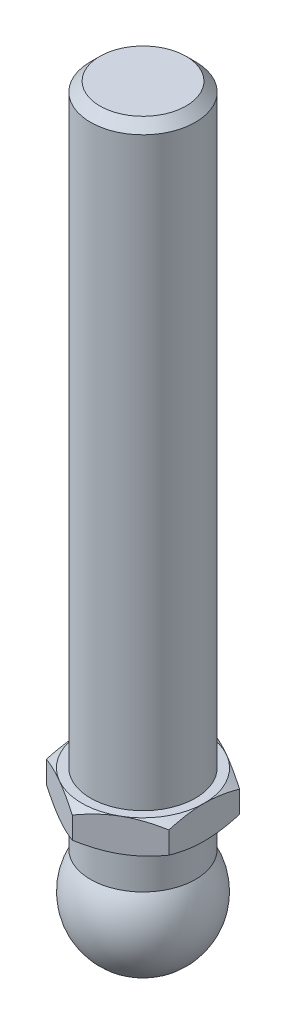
ISO-10303-21;
HEADER;
FILE_DESCRIPTION(('STEP AP214'),'2;1');
FILE_NAME('part.step','',(''),(''),'','','');
FILE_SCHEMA(('AUTOMOTIVE_DESIGN { 1 0 10303 214 1 1 1 1 }'));
ENDSEC;
DATA;
#1=APPLICATION_CONTEXT('core data for automotive mechanical design processes');
#2=APPLICATION_PROTOCOL_DEFINITION('international standard','automotive_design',2000,#1);
#3=PRODUCT_CONTEXT('',#1,'mechanical');
#4=PRODUCT('Part','Part','',(#3));
#5=PRODUCT_RELATED_PRODUCT_CATEGORY('part','',(#4));
#6=PRODUCT_DEFINITION_FORMATION('','',#4);
#7=PRODUCT_DEFINITION_CONTEXT('part definition',#1,'design');
#8=PRODUCT_DEFINITION('design','',#6,#7);
#9=PRODUCT_DEFINITION_SHAPE('','',#8);
#10=(LENGTH_UNIT() NAMED_UNIT(*) SI_UNIT(.MILLI.,.METRE.));
#11=(NAMED_UNIT(*) PLANE_ANGLE_UNIT() SI_UNIT($,.RADIAN.));
#12=(NAMED_UNIT(*) SI_UNIT($,.STERADIAN.) SOLID_ANGLE_UNIT());
#13=UNCERTAINTY_MEASURE_WITH_UNIT(LENGTH_MEASURE(1.E-05),#10,'distance_accuracy_value','');
#14=(GEOMETRIC_REPRESENTATION_CONTEXT(3) GLOBAL_UNCERTAINTY_ASSIGNED_CONTEXT((#13)) GLOBAL_UNIT_ASSIGNED_CONTEXT((#10,
#11,#12)) REPRESENTATION_CONTEXT('',''));
#15=CARTESIAN_POINT('',(0.,0.,0.));
#16=DIRECTION('',(0.,0.,1.));
#17=DIRECTION('',(1.,0.,0.));
#18=AXIS2_PLACEMENT_3D('',#15,#16,#17);
#19=CARTESIAN_POINT('',(0.,12.25,0.));
#20=DIRECTION('',(0.,-1.,0.));
#21=DIRECTION('',(0.,0.,-1.));
#22=AXIS2_PLACEMENT_3D('',#19,#20,#21);
#23=CONICAL_SURFACE('',#22,7.,1.0471975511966);
#24=CARTESIAN_POINT('',(-7.,8.18828268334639,12.1648696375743));
#25=CARTESIAN_POINT('',(-7.,8.33391573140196,11.8738003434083));
#26=CARTESIAN_POINT('',(-7.,8.47854589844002,11.5822239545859));
#27=CARTESIAN_POINT('',(-7.,8.76531569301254,10.997825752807));
#28=CARTESIAN_POINT('',(-7.,8.90745515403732,10.7050038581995));
#29=CARTESIAN_POINT('',(-7.,9.18902214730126,10.117331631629));
#30=CARTESIAN_POINT('',(-7.,9.32844364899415,9.82247840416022));
#31=CARTESIAN_POINT('',(-7.,9.60360604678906,9.23106328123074));
#32=CARTESIAN_POINT('',(-7.,9.73934701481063,8.93450141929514));
#33=CARTESIAN_POINT('',(-7.,10.0123110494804,8.32593520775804));
#34=CARTESIAN_POINT('',(-7.,10.149325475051,8.01383696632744));
#35=CARTESIAN_POINT('',(-7.,10.4171383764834,7.38695797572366));
#36=CARTESIAN_POINT('',(-7.,10.5479365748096,7.07217710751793));
#37=CARTESIAN_POINT('',(-7.,10.8015530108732,6.43962449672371));
#38=CARTESIAN_POINT('',(-7.,10.924376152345,6.1218547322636));
#39=CARTESIAN_POINT('',(-7.,11.1599016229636,5.48260317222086));
#40=CARTESIAN_POINT('',(-7.,11.2726050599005,5.1611217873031));
#41=CARTESIAN_POINT('',(-7.,11.5099014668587,4.4382173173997));
#42=CARTESIAN_POINT('',(-7.,11.6311181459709,4.03566892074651));
#43=CARTESIAN_POINT('',(-7.,11.8469740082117,3.22331060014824));
#44=CARTESIAN_POINT('',(-7.,11.9416155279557,2.81350131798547));
#45=CARTESIAN_POINT('',(-7.,12.0569999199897,2.19742561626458));
#46=CARTESIAN_POINT('',(-7.,12.0908518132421,1.99359214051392));
#47=CARTESIAN_POINT('',(-7.,12.1493191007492,1.5846161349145));
#48=CARTESIAN_POINT('',(-7.,12.1739358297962,1.37947379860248));
#49=CARTESIAN_POINT('',(-7.,12.2131968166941,0.968289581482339));
#50=CARTESIAN_POINT('',(-7.,12.2278439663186,0.762247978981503));
#51=CARTESIAN_POINT('',(-7.,12.2467021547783,0.349683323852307));
#52=CARTESIAN_POINT('',(-7.,12.2509132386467,0.143160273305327));
#53=CARTESIAN_POINT('',(-7.,12.2487493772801,-0.271082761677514));
#54=CARTESIAN_POINT('',(-7.,12.2423100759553,-0.478802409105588));
#55=CARTESIAN_POINT('',(-7.,12.2189433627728,-0.893645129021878));
#56=CARTESIAN_POINT('',(-7.,12.2020159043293,-1.10076819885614));
#57=CARTESIAN_POINT('',(-7.,12.1582124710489,-1.51403043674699));
#58=CARTESIAN_POINT('',(-7.,12.1313327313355,-1.72016920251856));
#59=CARTESIAN_POINT('',(-7.,12.0684180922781,-2.13103319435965));
#60=CARTESIAN_POINT('',(-7.,12.0323828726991,-2.33575837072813));
#61=CARTESIAN_POINT('',(-7.,11.9105686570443,-2.95437912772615));
#62=CARTESIAN_POINT('',(-7.,11.8118729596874,-3.36575077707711));
#63=CARTESIAN_POINT('',(-7.,11.5884533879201,-4.18138012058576));
#64=CARTESIAN_POINT('',(-7.,11.4637148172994,-4.58563365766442));
#65=CARTESIAN_POINT('',(-7.,11.2233248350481,-5.3032089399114));
#66=CARTESIAN_POINT('',(-7.,11.1112875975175,-5.61775957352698));
#67=CARTESIAN_POINT('',(-7.,10.8778514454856,-6.2432502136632));
#68=CARTESIAN_POINT('',(-7.,10.7564551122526,-6.55419118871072));
#69=CARTESIAN_POINT('',(-7.,10.5062070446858,-7.17328528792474));
#70=CARTESIAN_POINT('',(-7.,10.3773503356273,-7.48143638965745));
#71=CARTESIAN_POINT('',(-7.,10.1137823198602,-8.09523802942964));
#72=CARTESIAN_POINT('',(-7.,9.97907065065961,-8.40088841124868));
#73=CARTESIAN_POINT('',(-7.,9.71078407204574,-8.99716345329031));
#74=CARTESIAN_POINT('',(-7.,9.57740317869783,-9.28787568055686));
#75=CARTESIAN_POINT('',(-7.,9.30714715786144,-9.86766295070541));
#76=CARTESIAN_POINT('',(-7.,9.17027208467,-10.1567380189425));
#77=CARTESIAN_POINT('',(-7.,8.89389786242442,-10.7329937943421));
#78=CARTESIAN_POINT('',(-7.,8.75440383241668,-11.0201769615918));
#79=CARTESIAN_POINT('',(-7.,8.47302286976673,-11.5933594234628));
#80=CARTESIAN_POINT('',(-7.,8.3311360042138,-11.879358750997));
#81=CARTESIAN_POINT('',(-7.,8.18828268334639,-12.1648696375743));
#82=B_SPLINE_CURVE_WITH_KNOTS('',3,(#24,#25,#26,#27,#28,#29,#30,#31,#32,#33,#34,#35,#36,#37,#38,
#39,#40,#41,#42,#43,#44,#45,#46,#47,#48,#49,#50,#51,#52,#53,#54,#55,#56,#57,#58,#59,#60,#61,#62,
#63,#64,#65,#66,#67,#68,#69,#70,#71,#72,#73,#74,#75,#76,#77,#78,#79,#80,#81),.UNSPECIFIED.,.F.,
.F.,(4,2,2,2,2,2,2,2,2,2,2,2,2,2,2,2,2,2,2,2,2,2,2,2,2,2,2,2,4),(0.,0.976413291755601,
1.95289161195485,2.93133423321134,3.90975772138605,4.93225217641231,5.95479223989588,
6.97669748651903,7.99849072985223,9.25906449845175,10.5195273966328,11.1392271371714,
11.7588372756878,12.3782676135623,12.9976952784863,13.6208795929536,14.2440666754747,
14.8674897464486,15.4909346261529,16.7587972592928,18.0273773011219,19.0289263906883,
20.0302002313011,21.0321496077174,22.0341611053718,22.9936838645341,23.9531917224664,
24.9109871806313,25.8687558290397),.UNSPECIFIED.);
#83=CARTESIAN_POINT('',(-7.,11.6247852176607,4.04145188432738));
#84=VERTEX_POINT('',#83);
#85=CARTESIAN_POINT('',(-7.,12.25,0.));
#86=VERTEX_POINT('',#85);
#87=EDGE_CURVE('E313',#84,#86,#82,.T.);
#88=ORIENTED_EDGE('',*,*,#87,.F.);
#89=CARTESIAN_POINT('',(0.0002,11.6247185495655,8.0830192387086));
#90=CARTESIAN_POINT('',(-0.153667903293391,11.6760001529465,7.99418356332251));
#91=CARTESIAN_POINT('',(-0.308109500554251,11.7249544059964,7.90501666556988));
#92=CARTESIAN_POINT('',(-0.618246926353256,11.8175672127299,7.72595873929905));
#93=CARTESIAN_POINT('',(-0.773943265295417,11.8612234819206,7.63606741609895));
#94=CARTESIAN_POINT('',(-1.24352516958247,11.9833884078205,7.36495417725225));
#95=CARTESIAN_POINT('',(-1.5592643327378,12.052874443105,7.18266208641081));
#96=CARTESIAN_POINT('',(-2.03176224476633,12.1343550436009,6.9098652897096));
#97=CARTESIAN_POINT('',(-2.18710922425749,12.1575665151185,6.82017566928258));
#98=CARTESIAN_POINT('',(-2.49850511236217,12.1964887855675,6.64039116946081));
#99=CARTESIAN_POINT('',(-2.65455395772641,12.2122002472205,6.55029632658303));
#100=CARTESIAN_POINT('',(-2.96692267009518,12.2357220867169,6.3699501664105));
#101=CARTESIAN_POINT('',(-3.12324202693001,12.2435414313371,6.27969914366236));
#102=CARTESIAN_POINT('',(-3.43601650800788,12.2511197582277,6.09911871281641));
#103=CARTESIAN_POINT('',(-3.59247162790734,12.250878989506,6.00878930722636));
#104=CARTESIAN_POINT('',(-4.02110687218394,12.2391402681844,5.76131663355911));
#105=CARTESIAN_POINT('',(-4.2931466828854,12.2194342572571,5.60425437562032));
#106=CARTESIAN_POINT('',(-4.8354194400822,12.1569465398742,5.29117305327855));
#107=CARTESIAN_POINT('',(-5.10565047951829,12.114143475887,5.13515508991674));
#108=CARTESIAN_POINT('',(-5.64901454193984,12.0071483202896,4.82144370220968));
#109=CARTESIAN_POINT('',(-5.92207900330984,11.9425029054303,4.66378986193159));
#110=CARTESIAN_POINT('',(-6.46413578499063,11.795783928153,4.35083323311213));
#111=CARTESIAN_POINT('',(-6.73313504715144,11.7137448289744,4.19552643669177));
#112=CARTESIAN_POINT('',(-7.0002,11.6247185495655,4.04133641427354));
#113=B_SPLINE_CURVE_WITH_KNOTS('',3,(#89,#90,#91,#92,#93,#94,#95,#96,#97,#98,#99,#100,#101,#102,
#103,#104,#105,#106,#107,#108,#109,#110,#111,#112),.UNSPECIFIED.,.F.,.F.,(4,2,2,2,2,2,2,2,2,2,2,
4),(0.,0.554727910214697,1.10969417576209,2.2219327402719,2.76443041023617,3.30688013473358,
3.84871284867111,4.3905288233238,5.33376515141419,6.27787517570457,7.2429241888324,
8.20607866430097),.UNSPECIFIED.);
#114=CARTESIAN_POINT('',(-3.5,12.25,6.06217782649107));
#115=VERTEX_POINT('',#114);
#116=EDGE_CURVE('E135',#115,#84,#113,.T.);
#117=ORIENTED_EDGE('',*,*,#116,.F.);
#118=CARTESIAN_POINT('',(0.,12.25,0.));
#119=DIRECTION('',(0.,-1.,0.));
#120=DIRECTION('',(0.,0.,-1.));
#121=AXIS2_PLACEMENT_3D('',#118,#119,#120);
#122=CIRCLE('',#121,7.);
#123=EDGE_CURVE('E283',#115,#86,#122,.T.);
#124=ORIENTED_EDGE('',*,*,#123,.T.);
#125=EDGE_LOOP('',(#88,#117,#124));
#126=FACE_BOUND('',#125,.T.);
#127=ADVANCED_FACE('F14',(#126),#23,.T.);
#128=CARTESIAN_POINT('',(-7.,11.6247852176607,-4.04145188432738));
#129=VERTEX_POINT('',#128);
#130=EDGE_CURVE('E193',#86,#129,#82,.T.);
#131=ORIENTED_EDGE('',*,*,#130,.F.);
#132=CARTESIAN_POINT('',(-3.5,12.25,-6.06217782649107));
#133=VERTEX_POINT('',#132);
#134=EDGE_CURVE('E195',#86,#133,#122,.T.);
#135=ORIENTED_EDGE('',*,*,#134,.T.);
#136=CARTESIAN_POINT('',(-7.0002,11.6247185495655,-4.04133641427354));
#137=CARTESIAN_POINT('',(-6.84633209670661,11.6760001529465,-4.13017208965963));
#138=CARTESIAN_POINT('',(-6.69189049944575,11.7249544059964,-4.21933898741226));
#139=CARTESIAN_POINT('',(-6.38175307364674,11.8175672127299,-4.39839691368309));
#140=CARTESIAN_POINT('',(-6.22605673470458,11.8612234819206,-4.48828823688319));
#141=CARTESIAN_POINT('',(-5.75647483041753,11.9833884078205,-4.75940147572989));
#142=CARTESIAN_POINT('',(-5.44073566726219,12.052874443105,-4.94169356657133));
#143=CARTESIAN_POINT('',(-4.96823775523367,12.1343550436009,-5.21449036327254));
#144=CARTESIAN_POINT('',(-4.81289077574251,12.1575665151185,-5.30417998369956));
#145=CARTESIAN_POINT('',(-4.50149488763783,12.1964887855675,-5.48396448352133));
#146=CARTESIAN_POINT('',(-4.34544604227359,12.2122002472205,-5.57405932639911));
#147=CARTESIAN_POINT('',(-4.03307732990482,12.2357220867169,-5.75440548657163));
#148=CARTESIAN_POINT('',(-3.87675797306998,12.2435414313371,-5.84465650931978));
#149=CARTESIAN_POINT('',(-3.56398349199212,12.2511197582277,-6.02523694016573));
#150=CARTESIAN_POINT('',(-3.40752837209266,12.250878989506,-6.11556634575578));
#151=CARTESIAN_POINT('',(-2.97889312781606,12.2391402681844,-6.36303901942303));
#152=CARTESIAN_POINT('',(-2.70685331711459,12.2194342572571,-6.52010127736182));
#153=CARTESIAN_POINT('',(-2.1645805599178,12.1569465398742,-6.83318259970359));
#154=CARTESIAN_POINT('',(-1.89434952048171,12.114143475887,-6.9892005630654));
#155=CARTESIAN_POINT('',(-1.35098545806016,12.0071483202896,-7.30291195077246));
#156=CARTESIAN_POINT('',(-1.07792099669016,11.9425029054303,-7.46056579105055));
#157=CARTESIAN_POINT('',(-0.535864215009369,11.795783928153,-7.77352241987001));
#158=CARTESIAN_POINT('',(-0.266864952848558,11.7137448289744,-7.92882921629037));
#159=CARTESIAN_POINT('',(0.000199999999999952,11.6247185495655,-8.0830192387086));
#160=B_SPLINE_CURVE_WITH_KNOTS('',3,(#136,#137,#138,#139,#140,#141,#142,#143,#144,#145,#146,
#147,#148,#149,#150,#151,#152,#153,#154,#155,#156,#157,#158,#159),.UNSPECIFIED.,.F.,.F.,(4,2,2,
2,2,2,2,2,2,2,2,4),(0.,0.554727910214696,1.10969417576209,2.2219327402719,2.76443041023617,
3.30688013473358,3.8487128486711,4.3905288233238,5.33376515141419,6.27787517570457,
7.2429241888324,8.20607866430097),.UNSPECIFIED.);
#161=EDGE_CURVE('E183',#129,#133,#160,.T.);
#162=ORIENTED_EDGE('',*,*,#161,.F.);
#163=EDGE_LOOP('',(#131,#135,#162));
#164=FACE_BOUND('',#163,.T.);
#165=ADVANCED_FACE('F192',(#164),#23,.T.);
#166=CARTESIAN_POINT('',(0.,11.6247852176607,-8.08290376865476));
#167=VERTEX_POINT('',#166);
#168=EDGE_CURVE('E197',#133,#167,#160,.T.);
#169=ORIENTED_EDGE('',*,*,#168,.F.);
#170=CARTESIAN_POINT('',(3.5,12.25,-6.06217782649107));
#171=VERTEX_POINT('',#170);
#172=EDGE_CURVE('E293',#133,#171,#122,.T.);
#173=ORIENTED_EDGE('',*,*,#172,.T.);
#174=CARTESIAN_POINT('',(-0.0002,11.6247185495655,-8.0830192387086));
#175=CARTESIAN_POINT('',(0.153667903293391,11.6760001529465,-7.99418356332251));
#176=CARTESIAN_POINT('',(0.308109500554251,11.7249544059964,-7.90501666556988));
#177=CARTESIAN_POINT('',(0.618246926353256,11.8175672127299,-7.72595873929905));
#178=CARTESIAN_POINT('',(0.773943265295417,11.8612234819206,-7.63606741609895));
#179=CARTESIAN_POINT('',(1.24352516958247,11.9833884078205,-7.36495417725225));
#180=CARTESIAN_POINT('',(1.5592643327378,12.052874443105,-7.18266208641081));
#181=CARTESIAN_POINT('',(2.03176224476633,12.1343550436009,-6.9098652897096));
#182=CARTESIAN_POINT('',(2.18710922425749,12.1575665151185,-6.82017566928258));
#183=CARTESIAN_POINT('',(2.49850511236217,12.1964887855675,-6.64039116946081));
#184=CARTESIAN_POINT('',(2.65455395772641,12.2122002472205,-6.55029632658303));
#185=CARTESIAN_POINT('',(2.96692267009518,12.2357220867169,-6.3699501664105));
#186=CARTESIAN_POINT('',(3.12324202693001,12.2435414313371,-6.27969914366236));
#187=CARTESIAN_POINT('',(3.43601650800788,12.2511197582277,-6.09911871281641));
#188=CARTESIAN_POINT('',(3.59247162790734,12.250878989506,-6.00878930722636));
#189=CARTESIAN_POINT('',(4.02110687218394,12.2391402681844,-5.76131663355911));
#190=CARTESIAN_POINT('',(4.2931466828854,12.2194342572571,-5.60425437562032));
#191=CARTESIAN_POINT('',(4.8354194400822,12.1569465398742,-5.29117305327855));
#192=CARTESIAN_POINT('',(5.10565047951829,12.114143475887,-5.13515508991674));
#193=CARTESIAN_POINT('',(5.64901454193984,12.0071483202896,-4.82144370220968));
#194=CARTESIAN_POINT('',(5.92207900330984,11.9425029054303,-4.66378986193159));
#195=CARTESIAN_POINT('',(6.46413578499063,11.795783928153,-4.35083323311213));
#196=CARTESIAN_POINT('',(6.73313504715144,11.7137448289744,-4.19552643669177));
#197=CARTESIAN_POINT('',(7.0002,11.6247185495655,-4.04133641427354));
#198=B_SPLINE_CURVE_WITH_KNOTS('',3,(#174,#175,#176,#177,#178,#179,#180,#181,#182,#183,#184,
#185,#186,#187,#188,#189,#190,#191,#192,#193,#194,#195,#196,#197),.UNSPECIFIED.,.F.,.F.,(4,2,2,
2,2,2,2,2,2,2,2,4),(0.,0.554727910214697,1.10969417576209,2.2219327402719,2.76443041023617,
3.30688013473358,3.84871284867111,4.3905288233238,5.33376515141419,6.27787517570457,
7.2429241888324,8.20607866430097),.UNSPECIFIED.);
#199=EDGE_CURVE('E243',#167,#171,#198,.T.);
#200=ORIENTED_EDGE('',*,*,#199,.F.);
#201=EDGE_LOOP('',(#169,#173,#200));
#202=FACE_BOUND('',#201,.T.);
#203=ADVANCED_FACE('F346',(#202),#23,.T.);
#204=CARTESIAN_POINT('',(7.,11.6247852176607,-4.04145188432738));
#205=VERTEX_POINT('',#204);
#206=EDGE_CURVE('E238',#171,#205,#198,.T.);
#207=ORIENTED_EDGE('',*,*,#206,.F.);
#208=CARTESIAN_POINT('',(7.,12.25,0.));
#209=VERTEX_POINT('',#208);
#210=EDGE_CURVE('E288',#171,#209,#122,.T.);
#211=ORIENTED_EDGE('',*,*,#210,.T.);
#212=CARTESIAN_POINT('',(7.,8.18828268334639,-12.1648696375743));
#213=CARTESIAN_POINT('',(7.,8.33391573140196,-11.8738003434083));
#214=CARTESIAN_POINT('',(7.,8.47854589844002,-11.5822239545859));
#215=CARTESIAN_POINT('',(7.,8.76531569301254,-10.997825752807));
#216=CARTESIAN_POINT('',(7.,8.90745515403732,-10.7050038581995));
#217=CARTESIAN_POINT('',(7.,9.18902214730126,-10.117331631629));
#218=CARTESIAN_POINT('',(7.,9.32844364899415,-9.82247840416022));
#219=CARTESIAN_POINT('',(7.,9.60360604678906,-9.23106328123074));
#220=CARTESIAN_POINT('',(7.,9.73934701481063,-8.93450141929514));
#221=CARTESIAN_POINT('',(7.,10.0123110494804,-8.32593520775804));
#222=CARTESIAN_POINT('',(7.,10.149325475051,-8.01383696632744));
#223=CARTESIAN_POINT('',(7.,10.4171383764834,-7.38695797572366));
#224=CARTESIAN_POINT('',(7.,10.5479365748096,-7.07217710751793));
#225=CARTESIAN_POINT('',(7.,10.8015530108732,-6.43962449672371));
#226=CARTESIAN_POINT('',(7.,10.924376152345,-6.1218547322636));
#227=CARTESIAN_POINT('',(7.,11.1599016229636,-5.48260317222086));
#228=CARTESIAN_POINT('',(7.,11.2726050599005,-5.1611217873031));
#229=CARTESIAN_POINT('',(7.,11.5099014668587,-4.4382173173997));
#230=CARTESIAN_POINT('',(7.,11.6311181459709,-4.03566892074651));
#231=CARTESIAN_POINT('',(7.,11.8469740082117,-3.22331060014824));
#232=CARTESIAN_POINT('',(7.,11.9416155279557,-2.81350131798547));
#233=CARTESIAN_POINT('',(7.,12.0569999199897,-2.19742561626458));
#234=CARTESIAN_POINT('',(7.,12.0908518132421,-1.99359214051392));
#235=CARTESIAN_POINT('',(7.,12.1493191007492,-1.5846161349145));
#236=CARTESIAN_POINT('',(7.,12.1739358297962,-1.37947379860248));
#237=CARTESIAN_POINT('',(7.,12.2131968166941,-0.968289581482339));
#238=CARTESIAN_POINT('',(7.,12.2278439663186,-0.762247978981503));
#239=CARTESIAN_POINT('',(7.,12.2467021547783,-0.349683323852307));
#240=CARTESIAN_POINT('',(7.,12.2509132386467,-0.143160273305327));
#241=CARTESIAN_POINT('',(7.,12.2487493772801,0.271082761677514));
#242=CARTESIAN_POINT('',(7.,12.2423100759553,0.478802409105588));
#243=CARTESIAN_POINT('',(7.,12.2189433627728,0.893645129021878));
#244=CARTESIAN_POINT('',(7.,12.2020159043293,1.10076819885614));
#245=CARTESIAN_POINT('',(7.,12.1582124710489,1.51403043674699));
#246=CARTESIAN_POINT('',(7.,12.1313327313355,1.72016920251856));
#247=CARTESIAN_POINT('',(7.,12.0684180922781,2.13103319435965));
#248=CARTESIAN_POINT('',(7.,12.0323828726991,2.33575837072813));
#249=CARTESIAN_POINT('',(7.,11.9105686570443,2.95437912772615));
#250=CARTESIAN_POINT('',(7.,11.8118729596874,3.36575077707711));
#251=CARTESIAN_POINT('',(7.,11.5884533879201,4.18138012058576));
#252=CARTESIAN_POINT('',(7.,11.4637148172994,4.58563365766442));
#253=CARTESIAN_POINT('',(7.,11.2233248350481,5.3032089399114));
#254=CARTESIAN_POINT('',(7.,11.1112875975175,5.61775957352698));
#255=CARTESIAN_POINT('',(7.,10.8778514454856,6.2432502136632));
#256=CARTESIAN_POINT('',(7.,10.7564551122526,6.55419118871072));
#257=CARTESIAN_POINT('',(7.,10.5062070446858,7.17328528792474));
#258=CARTESIAN_POINT('',(7.,10.3773503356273,7.48143638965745));
#259=CARTESIAN_POINT('',(7.,10.1137823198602,8.09523802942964));
#260=CARTESIAN_POINT('',(7.,9.97907065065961,8.40088841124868));
#261=CARTESIAN_POINT('',(7.,9.71078407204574,8.99716345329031));
#262=CARTESIAN_POINT('',(7.,9.57740317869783,9.28787568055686));
#263=CARTESIAN_POINT('',(7.,9.30714715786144,9.86766295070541));
#264=CARTESIAN_POINT('',(7.,9.17027208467,10.1567380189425));
#265=CARTESIAN_POINT('',(7.,8.89389786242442,10.7329937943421));
#266=CARTESIAN_POINT('',(7.,8.75440383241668,11.0201769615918));
#267=CARTESIAN_POINT('',(7.,8.47302286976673,11.5933594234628));
#268=CARTESIAN_POINT('',(7.,8.3311360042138,11.879358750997));
#269=CARTESIAN_POINT('',(7.,8.18828268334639,12.1648696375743));
#270=B_SPLINE_CURVE_WITH_KNOTS('',3,(#212,#213,#214,#215,#216,#217,#218,#219,#220,#221,#222,
#223,#224,#225,#226,#227,#228,#229,#230,#231,#232,#233,#234,#235,#236,#237,#238,#239,#240,#241,
#242,#243,#244,#245,#246,#247,#248,#249,#250,#251,#252,#253,#254,#255,#256,#257,#258,#259,#260,
#261,#262,#263,#264,#265,#266,#267,#268,#269),.UNSPECIFIED.,.F.,.F.,(4,2,2,2,2,2,2,2,2,2,2,2,2,
2,2,2,2,2,2,2,2,2,2,2,2,2,2,2,4),(0.,0.976413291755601,1.95289161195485,2.93133423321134,
3.90975772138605,4.93225217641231,5.95479223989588,6.97669748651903,7.99849072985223,
9.25906449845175,10.5195273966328,11.1392271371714,11.7588372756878,12.3782676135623,
12.9976952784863,13.6208795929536,14.2440666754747,14.8674897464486,15.4909346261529,
16.7587972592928,18.0273773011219,19.0289263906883,20.0302002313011,21.0321496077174,
22.0341611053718,22.9936838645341,23.9531917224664,24.9109871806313,25.8687558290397),.UNSPECIFIED.);
#271=EDGE_CURVE('E249',#205,#209,#270,.T.);
#272=ORIENTED_EDGE('',*,*,#271,.F.);
#273=EDGE_LOOP('',(#207,#211,#272));
#274=FACE_BOUND('',#273,.T.);
#275=ADVANCED_FACE('F356',(#274),#23,.T.);
#276=CARTESIAN_POINT('',(7.,11.6247852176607,4.04145188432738));
#277=VERTEX_POINT('',#276);
#278=EDGE_CURVE('E251',#209,#277,#270,.T.);
#279=ORIENTED_EDGE('',*,*,#278,.F.);
#280=CARTESIAN_POINT('',(3.5,12.25,6.06217782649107));
#281=VERTEX_POINT('',#280);
#282=EDGE_CURVE('E281',#209,#281,#122,.T.);
#283=ORIENTED_EDGE('',*,*,#282,.T.);
#284=CARTESIAN_POINT('',(7.0002,11.6247185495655,4.04133641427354));
#285=CARTESIAN_POINT('',(6.84633209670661,11.6760001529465,4.13017208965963));
#286=CARTESIAN_POINT('',(6.69189049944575,11.7249544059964,4.21933898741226));
#287=CARTESIAN_POINT('',(6.38175307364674,11.8175672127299,4.39839691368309));
#288=CARTESIAN_POINT('',(6.22605673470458,11.8612234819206,4.48828823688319));
#289=CARTESIAN_POINT('',(5.75647483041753,11.9833884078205,4.75940147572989));
#290=CARTESIAN_POINT('',(5.44073566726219,12.052874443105,4.94169356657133));
#291=CARTESIAN_POINT('',(4.96823775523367,12.1343550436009,5.21449036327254));
#292=CARTESIAN_POINT('',(4.81289077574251,12.1575665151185,5.30417998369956));
#293=CARTESIAN_POINT('',(4.50149488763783,12.1964887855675,5.48396448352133));
#294=CARTESIAN_POINT('',(4.34544604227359,12.2122002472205,5.57405932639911));
#295=CARTESIAN_POINT('',(4.03307732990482,12.2357220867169,5.75440548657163));
#296=CARTESIAN_POINT('',(3.87675797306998,12.2435414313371,5.84465650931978));
#297=CARTESIAN_POINT('',(3.56398349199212,12.2511197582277,6.02523694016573));
#298=CARTESIAN_POINT('',(3.40752837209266,12.250878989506,6.11556634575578));
#299=CARTESIAN_POINT('',(2.97889312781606,12.2391402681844,6.36303901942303));
#300=CARTESIAN_POINT('',(2.70685331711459,12.2194342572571,6.52010127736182));
#301=CARTESIAN_POINT('',(2.1645805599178,12.1569465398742,6.83318259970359));
#302=CARTESIAN_POINT('',(1.89434952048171,12.114143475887,6.9892005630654));
#303=CARTESIAN_POINT('',(1.35098545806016,12.0071483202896,7.30291195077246));
#304=CARTESIAN_POINT('',(1.07792099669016,11.9425029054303,7.46056579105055));
#305=CARTESIAN_POINT('',(0.535864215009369,11.795783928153,7.77352241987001));
#306=CARTESIAN_POINT('',(0.266864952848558,11.7137448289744,7.92882921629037));
#307=CARTESIAN_POINT('',(-0.000199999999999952,11.6247185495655,8.0830192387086));
#308=B_SPLINE_CURVE_WITH_KNOTS('',3,(#284,#285,#286,#287,#288,#289,#290,#291,#292,#293,#294,
#295,#296,#297,#298,#299,#300,#301,#302,#303,#304,#305,#306,#307),.UNSPECIFIED.,.F.,.F.,(4,2,2,
2,2,2,2,2,2,2,2,4),(0.,0.554727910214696,1.10969417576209,2.2219327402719,2.76443041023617,
3.30688013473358,3.8487128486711,4.3905288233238,5.33376515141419,6.27787517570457,
7.2429241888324,8.20607866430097),.UNSPECIFIED.);
#309=EDGE_CURVE('E126',#277,#281,#308,.T.);
#310=ORIENTED_EDGE('',*,*,#309,.F.);
#311=EDGE_LOOP('',(#279,#283,#310));
#312=FACE_BOUND('',#311,.T.);
#313=ADVANCED_FACE('F285',(#312),#23,.T.);
#314=CARTESIAN_POINT('',(0.,11.6247852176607,8.08290376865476));
#315=VERTEX_POINT('',#314);
#316=EDGE_CURVE('E116',#281,#315,#308,.T.);
#317=ORIENTED_EDGE('',*,*,#316,.F.);
#318=EDGE_CURVE('E274',#281,#115,#122,.T.);
#319=ORIENTED_EDGE('',*,*,#318,.T.);
#320=EDGE_CURVE('E29',#315,#115,#113,.T.);
#321=ORIENTED_EDGE('',*,*,#320,.F.);
#322=EDGE_LOOP('',(#317,#319,#321));
#323=FACE_BOUND('',#322,.T.);
#324=ADVANCED_FACE('F273',(#323),#23,.T.);
#325=CARTESIAN_POINT('',(0.,80.25,0.));
#326=DIRECTION('',(0.,-1.,0.));
#327=DIRECTION('',(0.,0.,-1.));
#328=AXIS2_PLACEMENT_3D('',#325,#326,#327);
#329=PLANE('',#328);
#330=CARTESIAN_POINT('',(0.,80.25,0.));
#331=DIRECTION('',(0.,-1.,0.));
#332=DIRECTION('',(0.,0.,-1.));
#333=AXIS2_PLACEMENT_3D('',#330,#331,#332);
#334=CIRCLE('',#333,4.9265);
#335=CARTESIAN_POINT('',(0.,80.25,-4.9265));
#336=VERTEX_POINT('',#335);
#337=EDGE_CURVE('E22',#336,#336,#334,.T.);
#338=ORIENTED_EDGE('',*,*,#337,.F.);
#339=EDGE_LOOP('',(#338));
#340=FACE_BOUND('',#339,.T.);
#341=ADVANCED_FACE('F16',(#340),#329,.F.);
#342=CARTESIAN_POINT('',(0.,80.25,0.));
#343=DIRECTION('',(0.,-1.,0.));
#344=DIRECTION('',(0.,0.,-1.));
#345=AXIS2_PLACEMENT_3D('',#342,#343,#344);
#346=CONICAL_SURFACE('',#345,4.9265,0.785398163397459);
#347=CARTESIAN_POINT('',(0.,79.1765,0.));
#348=DIRECTION('',(0.,-1.,0.));
#349=DIRECTION('',(0.,0.,-1.));
#350=AXIS2_PLACEMENT_3D('',#347,#348,#349);
#351=CIRCLE('',#350,6.);
#352=CARTESIAN_POINT('',(0.,79.1765,-6.));
#353=VERTEX_POINT('',#352);
#354=EDGE_CURVE('E290',#353,#353,#351,.T.);
#355=ORIENTED_EDGE('',*,*,#354,.F.);
#356=EDGE_LOOP('',(#355));
#357=FACE_BOUND('',#356,.T.);
#358=ORIENTED_EDGE('',*,*,#337,.T.);
#359=EDGE_LOOP('',(#358));
#360=FACE_BOUND('',#359,.T.);
#361=ADVANCED_FACE('F354',(#357,#360),#346,.T.);
#362=CARTESIAN_POINT('',(0.,-7.,0.));
#363=DIRECTION('',(0.,-1.,0.));
#364=DIRECTION('',(0.,0.,-1.));
#365=AXIS2_PLACEMENT_3D('',#362,#363,#364);
#366=CYLINDRICAL_SURFACE('',#365,6.);
#367=CARTESIAN_POINT('',(0.,12.25,0.));
#368=DIRECTION('',(0.,-1.,0.));
#369=DIRECTION('',(0.,0.,-1.));
#370=AXIS2_PLACEMENT_3D('',#367,#368,#369);
#371=CIRCLE('',#370,6.);
#372=CARTESIAN_POINT('',(0.,12.25,-6.));
#373=VERTEX_POINT('',#372);
#374=EDGE_CURVE('E287',#373,#373,#371,.T.);
#375=ORIENTED_EDGE('',*,*,#374,.F.);
#376=EDGE_LOOP('',(#375));
#377=FACE_BOUND('',#376,.T.);
#378=ORIENTED_EDGE('',*,*,#354,.T.);
#379=EDGE_LOOP('',(#378));
#380=FACE_BOUND('',#379,.T.);
#381=ADVANCED_FACE('F439',(#377,#380),#366,.T.);
#382=CARTESIAN_POINT('',(6.,12.25,0.));
#383=DIRECTION('',(0.,-1.,0.));
#384=DIRECTION('',(0.,0.,-1.));
#385=AXIS2_PLACEMENT_3D('',#382,#383,#384);
#386=PLANE('',#385);
#387=ORIENTED_EDGE('',*,*,#282,.F.);
#388=ORIENTED_EDGE('',*,*,#210,.F.);
#389=ORIENTED_EDGE('',*,*,#172,.F.);
#390=ORIENTED_EDGE('',*,*,#134,.F.);
#391=ORIENTED_EDGE('',*,*,#123,.F.);
#392=ORIENTED_EDGE('',*,*,#318,.F.);
#393=EDGE_LOOP('',(#387,#388,#389,#390,#391,#392));
#394=FACE_BOUND('',#393,.T.);
#395=ORIENTED_EDGE('',*,*,#374,.T.);
#396=EDGE_LOOP('',(#395));
#397=FACE_BOUND('',#396,.T.);
#398=ADVANCED_FACE('F278',(#394,#397),#386,.F.);
#399=CARTESIAN_POINT('',(-7.,8.5,-4.04145188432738));
#400=DIRECTION('',(-1.,0.,0.));
#401=DIRECTION('',(0.,0.,1.));
#402=AXIS2_PLACEMENT_3D('',#399,#400,#401);
#403=PLANE('',#402);
#404=ORIENTED_EDGE('',*,*,#87,.T.);
#405=ORIENTED_EDGE('',*,*,#130,.T.);
#406=DIRECTION('',(0.,1.,0.));
#407=VECTOR('',#406,1.);
#408=CARTESIAN_POINT('',(-7.,8.5,-4.04145188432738));
#409=LINE('',#408,#407);
#410=CARTESIAN_POINT('',(-7.,9.12521478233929,-4.04145188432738));
#411=VERTEX_POINT('',#410);
#412=EDGE_CURVE('E109',#411,#129,#409,.T.);
#413=ORIENTED_EDGE('',*,*,#412,.F.);
#414=CARTESIAN_POINT('',(-7.,12.5617173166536,-12.1648696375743));
#415=CARTESIAN_POINT('',(-7.,12.416084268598,-11.8738003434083));
#416=CARTESIAN_POINT('',(-7.,12.27145410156,-11.5822239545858));
#417=CARTESIAN_POINT('',(-7.,11.9846843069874,-10.997825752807));
#418=CARTESIAN_POINT('',(-7.,11.8425448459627,-10.7050038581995));
#419=CARTESIAN_POINT('',(-7.,11.5609778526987,-10.1173316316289));
#420=CARTESIAN_POINT('',(-7.,11.4215563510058,-9.82247840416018));
#421=CARTESIAN_POINT('',(-7.,11.1463939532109,-9.23106328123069));
#422=CARTESIAN_POINT('',(-7.,11.0106529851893,-8.93450141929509));
#423=CARTESIAN_POINT('',(-7.,10.7376889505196,-8.32593520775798));
#424=CARTESIAN_POINT('',(-7.,10.6006745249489,-8.01383696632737));
#425=CARTESIAN_POINT('',(-7.,10.3328616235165,-7.38695797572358));
#426=CARTESIAN_POINT('',(-7.,10.2020634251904,-7.07217710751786));
#427=CARTESIAN_POINT('',(-7.,9.94844698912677,-6.43962449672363));
#428=CARTESIAN_POINT('',(-7.,9.825623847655,-6.12185473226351));
#429=CARTESIAN_POINT('',(-7.,9.59009837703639,-5.48260317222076));
#430=CARTESIAN_POINT('',(-7.,9.47739494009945,-5.16112178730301));
#431=CARTESIAN_POINT('',(-7.,9.24009853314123,-4.4382173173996));
#432=CARTESIAN_POINT('',(-7.,9.11888185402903,-4.03566892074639));
#433=CARTESIAN_POINT('',(-7.,8.90302599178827,-3.22331060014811));
#434=CARTESIAN_POINT('',(-7.,8.80838447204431,-2.81350131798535));
#435=CARTESIAN_POINT('',(-7.,8.69300008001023,-2.19742561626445));
#436=CARTESIAN_POINT('',(-7.,8.65914818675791,-1.99359214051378));
#437=CARTESIAN_POINT('',(-7.,8.60068089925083,-1.58461613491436));
#438=CARTESIAN_POINT('',(-7.,8.5760641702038,-1.37947379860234));
#439=CARTESIAN_POINT('',(-7.,8.53680318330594,-0.968289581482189));
#440=CARTESIAN_POINT('',(-7.,8.52215603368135,-0.76224797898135));
#441=CARTESIAN_POINT('',(-7.,8.50329784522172,-0.349683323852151));
#442=CARTESIAN_POINT('',(-7.,8.49908676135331,-0.143160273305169));
#443=CARTESIAN_POINT('',(-7.,8.50125062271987,0.271082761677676));
#444=CARTESIAN_POINT('',(-7.,8.50768992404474,0.478802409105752));
#445=CARTESIAN_POINT('',(-7.,8.53105663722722,0.893645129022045));
#446=CARTESIAN_POINT('',(-7.,8.54798409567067,1.1007681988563));
#447=CARTESIAN_POINT('',(-7.,8.59178752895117,1.51403043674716));
#448=CARTESIAN_POINT('',(-7.,8.61866726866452,1.72016920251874));
#449=CARTESIAN_POINT('',(-7.,8.68158190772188,2.13103319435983));
#450=CARTESIAN_POINT('',(-7.,8.71761712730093,2.33575837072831));
#451=CARTESIAN_POINT('',(-7.,8.83943134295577,2.95437912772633));
#452=CARTESIAN_POINT('',(-7.,8.93812704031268,3.3657507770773));
#453=CARTESIAN_POINT('',(-7.,9.16154661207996,4.18138012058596));
#454=CARTESIAN_POINT('',(-7.,9.28628518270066,4.58563365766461));
#455=CARTESIAN_POINT('',(-7.,9.52667516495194,5.30320893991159));
#456=CARTESIAN_POINT('',(-7.,9.63871240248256,5.61775957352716));
#457=CARTESIAN_POINT('',(-7.,9.87214855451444,6.24325021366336));
#458=CARTESIAN_POINT('',(-7.,9.99354488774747,6.55419118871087));
#459=CARTESIAN_POINT('',(-7.,10.2437929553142,7.17328528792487));
#460=CARTESIAN_POINT('',(-7.,10.3726496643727,7.48143638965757));
#461=CARTESIAN_POINT('',(-7.,10.6362176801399,8.09523802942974));
#462=CARTESIAN_POINT('',(-7.,10.7709293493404,8.40088841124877));
#463=CARTESIAN_POINT('',(-7.,11.0392159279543,8.99716345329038));
#464=CARTESIAN_POINT('',(-7.,11.1725968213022,9.28787568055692));
#465=CARTESIAN_POINT('',(-7.,11.4428528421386,9.86766295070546));
#466=CARTESIAN_POINT('',(-7.,11.57972791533,10.1567380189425));
#467=CARTESIAN_POINT('',(-7.,11.8561021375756,10.7329937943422));
#468=CARTESIAN_POINT('',(-7.,11.9955961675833,11.0201769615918));
#469=CARTESIAN_POINT('',(-7.,12.2769771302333,11.5933594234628));
#470=CARTESIAN_POINT('',(-7.,12.4188639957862,11.879358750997));
#471=CARTESIAN_POINT('',(-7.,12.5617173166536,12.1648696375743));
#472=B_SPLINE_CURVE_WITH_KNOTS('',3,(#414,#415,#416,#417,#418,#419,#420,#421,#422,#423,#424,
#425,#426,#427,#428,#429,#430,#431,#432,#433,#434,#435,#436,#437,#438,#439,#440,#441,#442,#443,
#444,#445,#446,#447,#448,#449,#450,#451,#452,#453,#454,#455,#456,#457,#458,#459,#460,#461,#462,
#463,#464,#465,#466,#467,#468,#469,#470,#471),.UNSPECIFIED.,.F.,.F.,(4,2,2,2,2,2,2,2,2,2,2,2,2,
2,2,2,2,2,2,2,2,2,2,2,2,2,2,2,4),(0.,0.976413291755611,1.95289161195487,2.93133423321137,
3.90975772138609,4.93225217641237,5.95479223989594,6.97669748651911,7.99849072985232,
9.25906449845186,10.5195273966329,11.1392271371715,11.7588372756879,12.3782676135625,
12.9976952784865,13.6208795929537,14.2440666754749,14.8674897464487,15.490934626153,
16.758797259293,18.0273773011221,19.0289263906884,20.0302002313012,21.0321496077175,
22.0341611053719,22.9936838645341,23.9531917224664,24.9109871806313,25.8687558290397),.UNSPECIFIED.);
#473=CARTESIAN_POINT('',(-7.,8.5,0.));
#474=VERTEX_POINT('',#473);
#475=EDGE_CURVE('E199',#411,#474,#472,.T.);
#476=ORIENTED_EDGE('',*,*,#475,.T.);
#477=CARTESIAN_POINT('',(-7.,9.12521478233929,4.04145188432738));
#478=VERTEX_POINT('',#477);
#479=EDGE_CURVE('E196',#474,#478,#472,.T.);
#480=ORIENTED_EDGE('',*,*,#479,.T.);
#481=DIRECTION('',(0.,1.,0.));
#482=VECTOR('',#481,1.);
#483=CARTESIAN_POINT('',(-7.,8.5,4.04145188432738));
#484=LINE('',#483,#482);
#485=EDGE_CURVE('E118',#478,#84,#484,.T.);
#486=ORIENTED_EDGE('',*,*,#485,.T.);
#487=EDGE_LOOP('',(#404,#405,#413,#476,#480,#486));
#488=FACE_BOUND('',#487,.T.);
#489=ADVANCED_FACE('F224',(#488),#403,.T.);
#490=CARTESIAN_POINT('',(0.,8.5,-8.08290376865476));
#491=DIRECTION('',(-0.5,0.,-0.866025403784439));
#492=DIRECTION('',(-0.866025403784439,0.,0.5));
#493=AXIS2_PLACEMENT_3D('',#490,#491,#492);
#494=PLANE('',#493);
#495=ORIENTED_EDGE('',*,*,#161,.T.);
#496=ORIENTED_EDGE('',*,*,#168,.T.);
#497=DIRECTION('',(0.,1.,0.));
#498=VECTOR('',#497,1.);
#499=CARTESIAN_POINT('',(0.,8.5,-8.08290376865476));
#500=LINE('',#499,#498);
#501=CARTESIAN_POINT('',(0.,9.12521478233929,-8.08290376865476));
#502=VERTEX_POINT('',#501);
#503=EDGE_CURVE('E175',#502,#167,#500,.T.);
#504=ORIENTED_EDGE('',*,*,#503,.F.);
#505=CARTESIAN_POINT('',(0.0002,9.1252814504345,-8.0830192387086));
#506=CARTESIAN_POINT('',(-0.153667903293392,9.07399984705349,-7.99418356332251));
#507=CARTESIAN_POINT('',(-0.308109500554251,9.02504559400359,-7.90501666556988));
#508=CARTESIAN_POINT('',(-0.618246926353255,8.93243278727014,-7.72595873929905));
#509=CARTESIAN_POINT('',(-0.773943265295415,8.88877651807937,-7.63606741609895));
#510=CARTESIAN_POINT('',(-1.24352516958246,8.7666115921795,-7.36495417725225));
#511=CARTESIAN_POINT('',(-1.5592643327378,8.69712555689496,-7.18266208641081));
#512=CARTESIAN_POINT('',(-2.03176224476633,8.6156449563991,-6.9098652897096));
#513=CARTESIAN_POINT('',(-2.18710922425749,8.59243348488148,-6.82017566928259));
#514=CARTESIAN_POINT('',(-2.49850511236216,8.55351121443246,-6.64039116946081));
#515=CARTESIAN_POINT('',(-2.65455395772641,8.53779975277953,-6.55029632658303));
#516=CARTESIAN_POINT('',(-2.96692267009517,8.51427791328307,-6.36995016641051));
#517=CARTESIAN_POINT('',(-3.12324202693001,8.50645856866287,-6.27969914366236));
#518=CARTESIAN_POINT('',(-3.43601650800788,8.49888024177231,-6.09911871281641));
#519=CARTESIAN_POINT('',(-3.59247162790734,8.49912101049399,-6.00878930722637));
#520=CARTESIAN_POINT('',(-4.02110687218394,8.5108597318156,-5.76131663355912));
#521=CARTESIAN_POINT('',(-4.2931466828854,8.53056574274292,-5.60425437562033));
#522=CARTESIAN_POINT('',(-4.83541944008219,8.59305346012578,-5.29117305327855));
#523=CARTESIAN_POINT('',(-5.10565047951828,8.63585652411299,-5.13515508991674));
#524=CARTESIAN_POINT('',(-5.64901454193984,8.74285167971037,-4.82144370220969));
#525=CARTESIAN_POINT('',(-5.92207900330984,8.80749709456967,-4.66378986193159));
#526=CARTESIAN_POINT('',(-6.46413578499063,8.95421607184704,-4.35083323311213));
#527=CARTESIAN_POINT('',(-6.73313504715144,9.03625517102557,-4.19552643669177));
#528=CARTESIAN_POINT('',(-7.0002,9.1252814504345,-4.04133641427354));
#529=B_SPLINE_CURVE_WITH_KNOTS('',3,(#505,#506,#507,#508,#509,#510,#511,#512,#513,#514,#515,
#516,#517,#518,#519,#520,#521,#522,#523,#524,#525,#526,#527,#528),.UNSPECIFIED.,.F.,.F.,(4,2,2,
2,2,2,2,2,2,2,2,4),(0.,0.554727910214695,1.10969417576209,2.2219327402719,2.76443041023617,
3.30688013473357,3.8487128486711,4.39052882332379,5.33376515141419,6.27787517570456,
7.2429241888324,8.20607866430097),.UNSPECIFIED.);
#530=CARTESIAN_POINT('',(-3.5,8.5,-6.06217782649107));
#531=VERTEX_POINT('',#530);
#532=EDGE_CURVE('E201',#502,#531,#529,.T.);
#533=ORIENTED_EDGE('',*,*,#532,.T.);
#534=EDGE_CURVE('E186',#531,#411,#529,.T.);
#535=ORIENTED_EDGE('',*,*,#534,.T.);
#536=ORIENTED_EDGE('',*,*,#412,.T.);
#537=EDGE_LOOP('',(#495,#496,#504,#533,#535,#536));
#538=FACE_BOUND('',#537,.T.);
#539=ADVANCED_FACE('F182',(#538),#494,.T.);
#540=CARTESIAN_POINT('',(7.,8.5,-4.04145188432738));
#541=DIRECTION('',(0.5,0.,-0.866025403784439));
#542=DIRECTION('',(-0.866025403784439,0.,-0.5));
#543=AXIS2_PLACEMENT_3D('',#540,#541,#542);
#544=PLANE('',#543);
#545=ORIENTED_EDGE('',*,*,#199,.T.);
#546=ORIENTED_EDGE('',*,*,#206,.T.);
#547=DIRECTION('',(0.,1.,0.));
#548=VECTOR('',#547,1.);
#549=CARTESIAN_POINT('',(7.,8.5,-4.04145188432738));
#550=LINE('',#549,#548);
#551=CARTESIAN_POINT('',(7.,9.12521478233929,-4.04145188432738));
#552=VERTEX_POINT('',#551);
#553=EDGE_CURVE('E172',#552,#205,#550,.T.);
#554=ORIENTED_EDGE('',*,*,#553,.F.);
#555=CARTESIAN_POINT('',(7.0002,9.1252814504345,-4.04133641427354));
#556=CARTESIAN_POINT('',(6.84633209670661,9.07399984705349,-4.13017208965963));
#557=CARTESIAN_POINT('',(6.69189049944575,9.02504559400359,-4.21933898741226));
#558=CARTESIAN_POINT('',(6.38175307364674,8.93243278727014,-4.39839691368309));
#559=CARTESIAN_POINT('',(6.22605673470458,8.88877651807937,-4.48828823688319));
#560=CARTESIAN_POINT('',(5.75647483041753,8.7666115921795,-4.75940147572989));
#561=CARTESIAN_POINT('',(5.4407356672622,8.69712555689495,-4.94169356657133));
#562=CARTESIAN_POINT('',(4.96823775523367,8.6156449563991,-5.21449036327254));
#563=CARTESIAN_POINT('',(4.81289077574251,8.59243348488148,-5.30417998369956));
#564=CARTESIAN_POINT('',(4.50149488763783,8.55351121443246,-5.48396448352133));
#565=CARTESIAN_POINT('',(4.34544604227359,8.53779975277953,-5.57405932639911));
#566=CARTESIAN_POINT('',(4.03307732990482,8.51427791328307,-5.75440548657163));
#567=CARTESIAN_POINT('',(3.87675797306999,8.50645856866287,-5.84465650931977));
#568=CARTESIAN_POINT('',(3.56398349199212,8.49888024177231,-6.02523694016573));
#569=CARTESIAN_POINT('',(3.40752837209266,8.49912101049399,-6.11556634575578));
#570=CARTESIAN_POINT('',(2.97889312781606,8.5108597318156,-6.36303901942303));
#571=CARTESIAN_POINT('',(2.7068533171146,8.53056574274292,-6.52010127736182));
#572=CARTESIAN_POINT('',(2.1645805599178,8.59305346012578,-6.83318259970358));
#573=CARTESIAN_POINT('',(1.89434952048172,8.63585652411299,-6.9892005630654));
#574=CARTESIAN_POINT('',(1.35098545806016,8.74285167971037,-7.30291195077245));
#575=CARTESIAN_POINT('',(1.07792099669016,8.80749709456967,-7.46056579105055));
#576=CARTESIAN_POINT('',(0.535864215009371,8.95421607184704,-7.77352241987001));
#577=CARTESIAN_POINT('',(0.26686495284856,9.03625517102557,-7.92882921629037));
#578=CARTESIAN_POINT('',(-0.000200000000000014,9.1252814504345,-8.0830192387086));
#579=B_SPLINE_CURVE_WITH_KNOTS('',3,(#555,#556,#557,#558,#559,#560,#561,#562,#563,#564,#565,
#566,#567,#568,#569,#570,#571,#572,#573,#574,#575,#576,#577,#578),.UNSPECIFIED.,.F.,.F.,(4,2,2,
2,2,2,2,2,2,2,2,4),(0.,0.554727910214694,1.10969417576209,2.2219327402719,2.76443041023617,
3.30688013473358,3.8487128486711,4.39052882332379,5.33376515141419,6.27787517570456,
7.2429241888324,8.20607866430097),.UNSPECIFIED.);
#580=CARTESIAN_POINT('',(3.5,8.5,-6.06217782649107));
#581=VERTEX_POINT('',#580);
#582=EDGE_CURVE('E244',#552,#581,#579,.T.);
#583=ORIENTED_EDGE('',*,*,#582,.T.);
#584=EDGE_CURVE('E232',#581,#502,#579,.T.);
#585=ORIENTED_EDGE('',*,*,#584,.T.);
#586=ORIENTED_EDGE('',*,*,#503,.T.);
#587=EDGE_LOOP('',(#545,#546,#554,#583,#585,#586));
#588=FACE_BOUND('',#587,.T.);
#589=ADVANCED_FACE('F223',(#588),#544,.T.);
#590=CARTESIAN_POINT('',(7.,8.5,4.04145188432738));
#591=DIRECTION('',(1.,0.,0.));
#592=DIRECTION('',(0.,0.,-1.));
#593=AXIS2_PLACEMENT_3D('',#590,#591,#592);
#594=PLANE('',#593);
#595=ORIENTED_EDGE('',*,*,#271,.T.);
#596=ORIENTED_EDGE('',*,*,#278,.T.);
#597=DIRECTION('',(0.,1.,0.));
#598=VECTOR('',#597,1.);
#599=CARTESIAN_POINT('',(7.,8.5,4.04145188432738));
#600=LINE('',#599,#598);
#601=CARTESIAN_POINT('',(7.,9.12521478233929,4.04145188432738));
#602=VERTEX_POINT('',#601);
#603=EDGE_CURVE('E117',#602,#277,#600,.T.);
#604=ORIENTED_EDGE('',*,*,#603,.F.);
#605=CARTESIAN_POINT('',(7.,12.5617173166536,12.1648696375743));
#606=CARTESIAN_POINT('',(7.,12.416084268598,11.8738003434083));
#607=CARTESIAN_POINT('',(7.,12.27145410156,11.5822239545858));
#608=CARTESIAN_POINT('',(7.,11.9846843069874,10.997825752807));
#609=CARTESIAN_POINT('',(7.,11.8425448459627,10.7050038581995));
#610=CARTESIAN_POINT('',(7.,11.5609778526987,10.1173316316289));
#611=CARTESIAN_POINT('',(7.,11.4215563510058,9.82247840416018));
#612=CARTESIAN_POINT('',(7.,11.1463939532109,9.23106328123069));
#613=CARTESIAN_POINT('',(7.,11.0106529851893,8.93450141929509));
#614=CARTESIAN_POINT('',(7.,10.7376889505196,8.32593520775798));
#615=CARTESIAN_POINT('',(7.,10.6006745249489,8.01383696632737));
#616=CARTESIAN_POINT('',(7.,10.3328616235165,7.38695797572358));
#617=CARTESIAN_POINT('',(7.,10.2020634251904,7.07217710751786));
#618=CARTESIAN_POINT('',(7.,9.94844698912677,6.43962449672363));
#619=CARTESIAN_POINT('',(7.,9.825623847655,6.12185473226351));
#620=CARTESIAN_POINT('',(7.,9.59009837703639,5.48260317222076));
#621=CARTESIAN_POINT('',(7.,9.47739494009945,5.16112178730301));
#622=CARTESIAN_POINT('',(7.,9.24009853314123,4.4382173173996));
#623=CARTESIAN_POINT('',(7.,9.11888185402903,4.03566892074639));
#624=CARTESIAN_POINT('',(7.,8.90302599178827,3.22331060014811));
#625=CARTESIAN_POINT('',(7.,8.80838447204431,2.81350131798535));
#626=CARTESIAN_POINT('',(7.,8.69300008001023,2.19742561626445));
#627=CARTESIAN_POINT('',(7.,8.65914818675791,1.99359214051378));
#628=CARTESIAN_POINT('',(7.,8.60068089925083,1.58461613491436));
#629=CARTESIAN_POINT('',(7.,8.5760641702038,1.37947379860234));
#630=CARTESIAN_POINT('',(7.,8.53680318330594,0.968289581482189));
#631=CARTESIAN_POINT('',(7.,8.52215603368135,0.76224797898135));
#632=CARTESIAN_POINT('',(7.,8.50329784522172,0.349683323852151));
#633=CARTESIAN_POINT('',(7.,8.49908676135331,0.143160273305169));
#634=CARTESIAN_POINT('',(7.,8.50125062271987,-0.271082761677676));
#635=CARTESIAN_POINT('',(7.,8.50768992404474,-0.478802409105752));
#636=CARTESIAN_POINT('',(7.,8.53105663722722,-0.893645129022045));
#637=CARTESIAN_POINT('',(7.,8.54798409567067,-1.1007681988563));
#638=CARTESIAN_POINT('',(7.,8.59178752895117,-1.51403043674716));
#639=CARTESIAN_POINT('',(7.,8.61866726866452,-1.72016920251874));
#640=CARTESIAN_POINT('',(7.,8.68158190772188,-2.13103319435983));
#641=CARTESIAN_POINT('',(7.,8.71761712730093,-2.33575837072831));
#642=CARTESIAN_POINT('',(7.,8.83943134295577,-2.95437912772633));
#643=CARTESIAN_POINT('',(7.,8.93812704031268,-3.3657507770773));
#644=CARTESIAN_POINT('',(7.,9.16154661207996,-4.18138012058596));
#645=CARTESIAN_POINT('',(7.,9.28628518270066,-4.58563365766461));
#646=CARTESIAN_POINT('',(7.,9.52667516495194,-5.30320893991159));
#647=CARTESIAN_POINT('',(7.,9.63871240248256,-5.61775957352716));
#648=CARTESIAN_POINT('',(7.,9.87214855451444,-6.24325021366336));
#649=CARTESIAN_POINT('',(7.,9.99354488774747,-6.55419118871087));
#650=CARTESIAN_POINT('',(7.,10.2437929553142,-7.17328528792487));
#651=CARTESIAN_POINT('',(7.,10.3726496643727,-7.48143638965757));
#652=CARTESIAN_POINT('',(7.,10.6362176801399,-8.09523802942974));
#653=CARTESIAN_POINT('',(7.,10.7709293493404,-8.40088841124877));
#654=CARTESIAN_POINT('',(7.,11.0392159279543,-8.99716345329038));
#655=CARTESIAN_POINT('',(7.,11.1725968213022,-9.28787568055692));
#656=CARTESIAN_POINT('',(7.,11.4428528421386,-9.86766295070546));
#657=CARTESIAN_POINT('',(7.,11.57972791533,-10.1567380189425));
#658=CARTESIAN_POINT('',(7.,11.8561021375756,-10.7329937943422));
#659=CARTESIAN_POINT('',(7.,11.9955961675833,-11.0201769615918));
#660=CARTESIAN_POINT('',(7.,12.2769771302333,-11.5933594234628));
#661=CARTESIAN_POINT('',(7.,12.4188639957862,-11.879358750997));
#662=CARTESIAN_POINT('',(7.,12.5617173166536,-12.1648696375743));
#663=B_SPLINE_CURVE_WITH_KNOTS('',3,(#605,#606,#607,#608,#609,#610,#611,#612,#613,#614,#615,
#616,#617,#618,#619,#620,#621,#622,#623,#624,#625,#626,#627,#628,#629,#630,#631,#632,#633,#634,
#635,#636,#637,#638,#639,#640,#641,#642,#643,#644,#645,#646,#647,#648,#649,#650,#651,#652,#653,
#654,#655,#656,#657,#658,#659,#660,#661,#662),.UNSPECIFIED.,.F.,.F.,(4,2,2,2,2,2,2,2,2,2,2,2,2,
2,2,2,2,2,2,2,2,2,2,2,2,2,2,2,4),(0.,0.976413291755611,1.95289161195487,2.93133423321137,
3.90975772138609,4.93225217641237,5.95479223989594,6.97669748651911,7.99849072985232,
9.25906449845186,10.5195273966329,11.1392271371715,11.7588372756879,12.3782676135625,
12.9976952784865,13.6208795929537,14.2440666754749,14.8674897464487,15.490934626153,
16.758797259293,18.0273773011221,19.0289263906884,20.0302002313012,21.0321496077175,
22.0341611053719,22.9936838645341,23.9531917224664,24.9109871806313,25.8687558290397),.UNSPECIFIED.);
#664=CARTESIAN_POINT('',(7.,8.5,0.));
#665=VERTEX_POINT('',#664);
#666=EDGE_CURVE('E255',#602,#665,#663,.T.);
#667=ORIENTED_EDGE('',*,*,#666,.T.);
#668=EDGE_CURVE('E260',#665,#552,#663,.T.);
#669=ORIENTED_EDGE('',*,*,#668,.T.);
#670=ORIENTED_EDGE('',*,*,#553,.T.);
#671=EDGE_LOOP('',(#595,#596,#604,#667,#669,#670));
#672=FACE_BOUND('',#671,.T.);
#673=ADVANCED_FACE('F153',(#672),#594,.T.);
#674=CARTESIAN_POINT('',(0.,8.5,8.08290376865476));
#675=DIRECTION('',(0.5,0.,0.866025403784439));
#676=DIRECTION('',(0.866025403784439,0.,-0.5));
#677=AXIS2_PLACEMENT_3D('',#674,#675,#676);
#678=PLANE('',#677);
#679=ORIENTED_EDGE('',*,*,#309,.T.);
#680=ORIENTED_EDGE('',*,*,#316,.T.);
#681=DIRECTION('',(0.,1.,0.));
#682=VECTOR('',#681,1.);
#683=CARTESIAN_POINT('',(0.,8.5,8.08290376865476));
#684=LINE('',#683,#682);
#685=CARTESIAN_POINT('',(0.,9.12521478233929,8.08290376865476));
#686=VERTEX_POINT('',#685);
#687=EDGE_CURVE('E104',#686,#315,#684,.T.);
#688=ORIENTED_EDGE('',*,*,#687,.F.);
#689=CARTESIAN_POINT('',(-0.0002,9.1252814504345,8.0830192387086));
#690=CARTESIAN_POINT('',(0.153667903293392,9.07399984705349,7.99418356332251));
#691=CARTESIAN_POINT('',(0.308109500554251,9.02504559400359,7.90501666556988));
#692=CARTESIAN_POINT('',(0.618246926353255,8.93243278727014,7.72595873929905));
#693=CARTESIAN_POINT('',(0.773943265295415,8.88877651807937,7.63606741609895));
#694=CARTESIAN_POINT('',(1.24352516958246,8.7666115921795,7.36495417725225));
#695=CARTESIAN_POINT('',(1.5592643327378,8.69712555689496,7.18266208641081));
#696=CARTESIAN_POINT('',(2.03176224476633,8.6156449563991,6.9098652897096));
#697=CARTESIAN_POINT('',(2.18710922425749,8.59243348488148,6.82017566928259));
#698=CARTESIAN_POINT('',(2.49850511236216,8.55351121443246,6.64039116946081));
#699=CARTESIAN_POINT('',(2.65455395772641,8.53779975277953,6.55029632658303));
#700=CARTESIAN_POINT('',(2.96692267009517,8.51427791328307,6.36995016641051));
#701=CARTESIAN_POINT('',(3.12324202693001,8.50645856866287,6.27969914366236));
#702=CARTESIAN_POINT('',(3.43601650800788,8.49888024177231,6.09911871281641));
#703=CARTESIAN_POINT('',(3.59247162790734,8.49912101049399,6.00878930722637));
#704=CARTESIAN_POINT('',(4.02110687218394,8.5108597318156,5.76131663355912));
#705=CARTESIAN_POINT('',(4.2931466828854,8.53056574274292,5.60425437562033));
#706=CARTESIAN_POINT('',(4.83541944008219,8.59305346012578,5.29117305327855));
#707=CARTESIAN_POINT('',(5.10565047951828,8.63585652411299,5.13515508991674));
#708=CARTESIAN_POINT('',(5.64901454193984,8.74285167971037,4.82144370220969));
#709=CARTESIAN_POINT('',(5.92207900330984,8.80749709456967,4.66378986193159));
#710=CARTESIAN_POINT('',(6.46413578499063,8.95421607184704,4.35083323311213));
#711=CARTESIAN_POINT('',(6.73313504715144,9.03625517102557,4.19552643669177));
#712=CARTESIAN_POINT('',(7.0002,9.1252814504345,4.04133641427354));
#713=B_SPLINE_CURVE_WITH_KNOTS('',3,(#689,#690,#691,#692,#693,#694,#695,#696,#697,#698,#699,
#700,#701,#702,#703,#704,#705,#706,#707,#708,#709,#710,#711,#712),.UNSPECIFIED.,.F.,.F.,(4,2,2,
2,2,2,2,2,2,2,2,4),(0.,0.554727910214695,1.10969417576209,2.2219327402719,2.76443041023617,
3.30688013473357,3.8487128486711,4.39052882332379,5.33376515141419,6.27787517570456,
7.2429241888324,8.20607866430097),.UNSPECIFIED.);
#714=CARTESIAN_POINT('',(3.5,8.5,6.06217782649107));
#715=VERTEX_POINT('',#714);
#716=EDGE_CURVE('E113',#686,#715,#713,.T.);
#717=ORIENTED_EDGE('',*,*,#716,.T.);
#718=EDGE_CURVE('E124',#715,#602,#713,.T.);
#719=ORIENTED_EDGE('',*,*,#718,.T.);
#720=ORIENTED_EDGE('',*,*,#603,.T.);
#721=EDGE_LOOP('',(#679,#680,#688,#717,#719,#720));
#722=FACE_BOUND('',#721,.T.);
#723=ADVANCED_FACE('F112',(#722),#678,.T.);
#724=CARTESIAN_POINT('',(-7.,8.5,4.04145188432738));
#725=DIRECTION('',(-0.5,0.,0.866025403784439));
#726=DIRECTION('',(0.866025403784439,0.,0.5));
#727=AXIS2_PLACEMENT_3D('',#724,#725,#726);
#728=PLANE('',#727);
#729=ORIENTED_EDGE('',*,*,#320,.T.);
#730=ORIENTED_EDGE('',*,*,#116,.T.);
#731=ORIENTED_EDGE('',*,*,#485,.F.);
#732=CARTESIAN_POINT('',(-7.0002,9.1252814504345,4.04133641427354));
#733=CARTESIAN_POINT('',(-6.84633209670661,9.07399984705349,4.13017208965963));
#734=CARTESIAN_POINT('',(-6.69189049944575,9.02504559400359,4.21933898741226));
#735=CARTESIAN_POINT('',(-6.38175307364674,8.93243278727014,4.39839691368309));
#736=CARTESIAN_POINT('',(-6.22605673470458,8.88877651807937,4.48828823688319));
#737=CARTESIAN_POINT('',(-5.75647483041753,8.7666115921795,4.75940147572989));
#738=CARTESIAN_POINT('',(-5.4407356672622,8.69712555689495,4.94169356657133));
#739=CARTESIAN_POINT('',(-4.96823775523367,8.6156449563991,5.21449036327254));
#740=CARTESIAN_POINT('',(-4.81289077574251,8.59243348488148,5.30417998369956));
#741=CARTESIAN_POINT('',(-4.50149488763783,8.55351121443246,5.48396448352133));
#742=CARTESIAN_POINT('',(-4.34544604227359,8.53779975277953,5.57405932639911));
#743=CARTESIAN_POINT('',(-4.03307732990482,8.51427791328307,5.75440548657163));
#744=CARTESIAN_POINT('',(-3.87675797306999,8.50645856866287,5.84465650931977));
#745=CARTESIAN_POINT('',(-3.56398349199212,8.49888024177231,6.02523694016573));
#746=CARTESIAN_POINT('',(-3.40752837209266,8.49912101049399,6.11556634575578));
#747=CARTESIAN_POINT('',(-2.97889312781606,8.5108597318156,6.36303901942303));
#748=CARTESIAN_POINT('',(-2.7068533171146,8.53056574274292,6.52010127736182));
#749=CARTESIAN_POINT('',(-2.1645805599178,8.59305346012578,6.83318259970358));
#750=CARTESIAN_POINT('',(-1.89434952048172,8.63585652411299,6.9892005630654));
#751=CARTESIAN_POINT('',(-1.35098545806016,8.74285167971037,7.30291195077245));
#752=CARTESIAN_POINT('',(-1.07792099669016,8.80749709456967,7.46056579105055));
#753=CARTESIAN_POINT('',(-0.535864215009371,8.95421607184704,7.77352241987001));
#754=CARTESIAN_POINT('',(-0.26686495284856,9.03625517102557,7.92882921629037));
#755=CARTESIAN_POINT('',(0.000200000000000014,9.1252814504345,8.0830192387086));
#756=B_SPLINE_CURVE_WITH_KNOTS('',3,(#732,#733,#734,#735,#736,#737,#738,#739,#740,#741,#742,
#743,#744,#745,#746,#747,#748,#749,#750,#751,#752,#753,#754,#755),.UNSPECIFIED.,.F.,.F.,(4,2,2,
2,2,2,2,2,2,2,2,4),(0.,0.554727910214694,1.10969417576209,2.2219327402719,2.76443041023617,
3.30688013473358,3.8487128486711,4.39052882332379,5.33376515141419,6.27787517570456,
7.2429241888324,8.20607866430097),.UNSPECIFIED.);
#757=CARTESIAN_POINT('',(-3.5,8.5,6.06217782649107));
#758=VERTEX_POINT('',#757);
#759=EDGE_CURVE('E36',#478,#758,#756,.T.);
#760=ORIENTED_EDGE('',*,*,#759,.T.);
#761=EDGE_CURVE('E101',#758,#686,#756,.T.);
#762=ORIENTED_EDGE('',*,*,#761,.T.);
#763=ORIENTED_EDGE('',*,*,#687,.T.);
#764=EDGE_LOOP('',(#729,#730,#731,#760,#762,#763));
#765=FACE_BOUND('',#764,.T.);
#766=ADVANCED_FACE('F103',(#765),#728,.T.);
#767=CARTESIAN_POINT('',(0.,0.,0.));
#768=DIRECTION('',(0.,-1.,0.));
#769=DIRECTION('',(-1.,0.,0.));
#770=AXIS2_PLACEMENT_3D('',#767,#768,#769);
#771=SPHERICAL_SURFACE('',#770,7.);
#772=CARTESIAN_POINT('',(0.,4.2,0.));
#773=DIRECTION('',(0.,1.,0.));
#774=DIRECTION('',(0.,0.,1.));
#775=AXIS2_PLACEMENT_3D('',#772,#773,#774);
#776=CIRCLE('',#775,5.6);
#777=CARTESIAN_POINT('',(0.,4.2,5.6));
#778=VERTEX_POINT('',#777);
#779=EDGE_CURVE('E9',#778,#778,#776,.T.);
#780=ORIENTED_EDGE('',*,*,#779,.F.);
#781=EDGE_LOOP('',(#780));
#782=FACE_BOUND('',#781,.T.);
#783=ADVANCED_FACE('F160',(#782),#771,.T.);
#784=CARTESIAN_POINT('',(6.,4.2,0.));
#785=DIRECTION('',(0.,1.,0.));
#786=DIRECTION('',(0.,0.,1.));
#787=AXIS2_PLACEMENT_3D('',#784,#785,#786);
#788=PLANE('',#787);
#789=ORIENTED_EDGE('',*,*,#779,.T.);
#790=EDGE_LOOP('',(#789));
#791=FACE_BOUND('',#790,.T.);
#792=CARTESIAN_POINT('',(0.,4.2,0.));
#793=DIRECTION('',(0.,-1.,0.));
#794=DIRECTION('',(0.,0.,-1.));
#795=AXIS2_PLACEMENT_3D('',#792,#793,#794);
#796=CIRCLE('',#795,6.);
#797=CARTESIAN_POINT('',(0.,4.2,-6.));
#798=VERTEX_POINT('',#797);
#799=EDGE_CURVE('E309',#798,#798,#796,.T.);
#800=ORIENTED_EDGE('',*,*,#799,.T.);
#801=EDGE_LOOP('',(#800));
#802=FACE_BOUND('',#801,.T.);
#803=ADVANCED_FACE('F379',(#791,#802),#788,.F.);
#804=CARTESIAN_POINT('',(0.,-7.,0.));
#805=DIRECTION('',(0.,-1.,0.));
#806=DIRECTION('',(0.,0.,-1.));
#807=AXIS2_PLACEMENT_3D('',#804,#805,#806);
#808=CYLINDRICAL_SURFACE('',#807,6.);
#809=ORIENTED_EDGE('',*,*,#799,.F.);
#810=EDGE_LOOP('',(#809));
#811=FACE_BOUND('',#810,.T.);
#812=CARTESIAN_POINT('',(0.,8.5,0.));
#813=DIRECTION('',(0.,-1.,0.));
#814=DIRECTION('',(0.,0.,-1.));
#815=AXIS2_PLACEMENT_3D('',#812,#813,#814);
#816=CIRCLE('',#815,6.);
#817=CARTESIAN_POINT('',(0.,8.5,-6.));
#818=VERTEX_POINT('',#817);
#819=EDGE_CURVE('E304',#818,#818,#816,.T.);
#820=ORIENTED_EDGE('',*,*,#819,.T.);
#821=EDGE_LOOP('',(#820));
#822=FACE_BOUND('',#821,.T.);
#823=ADVANCED_FACE('F373',(#811,#822),#808,.T.);
#824=CARTESIAN_POINT('',(0.,9.30829037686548,0.));
#825=DIRECTION('',(0.,1.,0.));
#826=DIRECTION('',(0.,0.,1.));
#827=AXIS2_PLACEMENT_3D('',#824,#825,#826);
#828=CONICAL_SURFACE('',#827,8.4,1.0471975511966);
#829=ORIENTED_EDGE('',*,*,#582,.F.);
#830=ORIENTED_EDGE('',*,*,#668,.F.);
#831=CARTESIAN_POINT('',(0.,8.5,0.));
#832=DIRECTION('',(0.,-1.,0.));
#833=DIRECTION('',(0.,0.,-1.));
#834=AXIS2_PLACEMENT_3D('',#831,#832,#833);
#835=CIRCLE('',#834,7.);
#836=EDGE_CURVE('E297',#581,#665,#835,.T.);
#837=ORIENTED_EDGE('',*,*,#836,.F.);
#838=EDGE_LOOP('',(#829,#830,#837));
#839=FACE_BOUND('',#838,.T.);
#840=ADVANCED_FACE('F147',(#839),#828,.T.);
#841=ORIENTED_EDGE('',*,*,#584,.F.);
#842=EDGE_CURVE('E303',#531,#581,#835,.T.);
#843=ORIENTED_EDGE('',*,*,#842,.F.);
#844=ORIENTED_EDGE('',*,*,#532,.F.);
#845=EDGE_LOOP('',(#841,#843,#844));
#846=FACE_BOUND('',#845,.T.);
#847=ADVANCED_FACE('F370',(#846),#828,.T.);
#848=ORIENTED_EDGE('',*,*,#534,.F.);
#849=EDGE_CURVE('E307',#474,#531,#835,.T.);
#850=ORIENTED_EDGE('',*,*,#849,.F.);
#851=ORIENTED_EDGE('',*,*,#475,.F.);
#852=EDGE_LOOP('',(#848,#850,#851));
#853=FACE_BOUND('',#852,.T.);
#854=ADVANCED_FACE('F326',(#853),#828,.T.);
#855=ORIENTED_EDGE('',*,*,#479,.F.);
#856=EDGE_CURVE('E301',#758,#474,#835,.T.);
#857=ORIENTED_EDGE('',*,*,#856,.F.);
#858=ORIENTED_EDGE('',*,*,#759,.F.);
#859=EDGE_LOOP('',(#855,#857,#858));
#860=FACE_BOUND('',#859,.T.);
#861=ADVANCED_FACE('F323',(#860),#828,.T.);
#862=ORIENTED_EDGE('',*,*,#666,.F.);
#863=ORIENTED_EDGE('',*,*,#718,.F.);
#864=EDGE_CURVE('E294',#665,#715,#835,.T.);
#865=ORIENTED_EDGE('',*,*,#864,.F.);
#866=EDGE_LOOP('',(#862,#863,#865));
#867=FACE_BOUND('',#866,.T.);
#868=ADVANCED_FACE('F330',(#867),#828,.T.);
#869=CARTESIAN_POINT('',(7.,8.5,0.));
#870=DIRECTION('',(0.,1.,0.));
#871=DIRECTION('',(0.,0.,1.));
#872=AXIS2_PLACEMENT_3D('',#869,#870,#871);
#873=PLANE('',#872);
#874=ORIENTED_EDGE('',*,*,#819,.F.);
#875=EDGE_LOOP('',(#874));
#876=FACE_BOUND('',#875,.T.);
#877=ORIENTED_EDGE('',*,*,#836,.T.);
#878=ORIENTED_EDGE('',*,*,#864,.T.);
#879=EDGE_CURVE('E122',#715,#758,#835,.T.);
#880=ORIENTED_EDGE('',*,*,#879,.T.);
#881=ORIENTED_EDGE('',*,*,#856,.T.);
#882=ORIENTED_EDGE('',*,*,#849,.T.);
#883=ORIENTED_EDGE('',*,*,#842,.T.);
#884=EDGE_LOOP('',(#877,#878,#880,#881,#882,#883));
#885=FACE_BOUND('',#884,.T.);
#886=ADVANCED_FACE('F328',(#876,#885),#873,.F.);
#887=ORIENTED_EDGE('',*,*,#716,.F.);
#888=ORIENTED_EDGE('',*,*,#761,.F.);
#889=ORIENTED_EDGE('',*,*,#879,.F.);
#890=EDGE_LOOP('',(#887,#888,#889));
#891=FACE_BOUND('',#890,.T.);
#892=ADVANCED_FACE('F120',(#891),#828,.T.);
#893=CLOSED_SHELL('',(#127,#165,#203,#275,#313,#324,#341,#361,#381,#398,#489,#539,#589,#673,
#723,#766,#783,#803,#823,#840,#847,#854,#861,#868,#886,#892));
#894=MANIFOLD_SOLID_BREP('B1',#893);
#895=ADVANCED_BREP_SHAPE_REPRESENTATION('',(#18,#894),#14);
#896=SHAPE_DEFINITION_REPRESENTATION(#9,#895);
ENDSEC;
END-ISO-10303-21;
